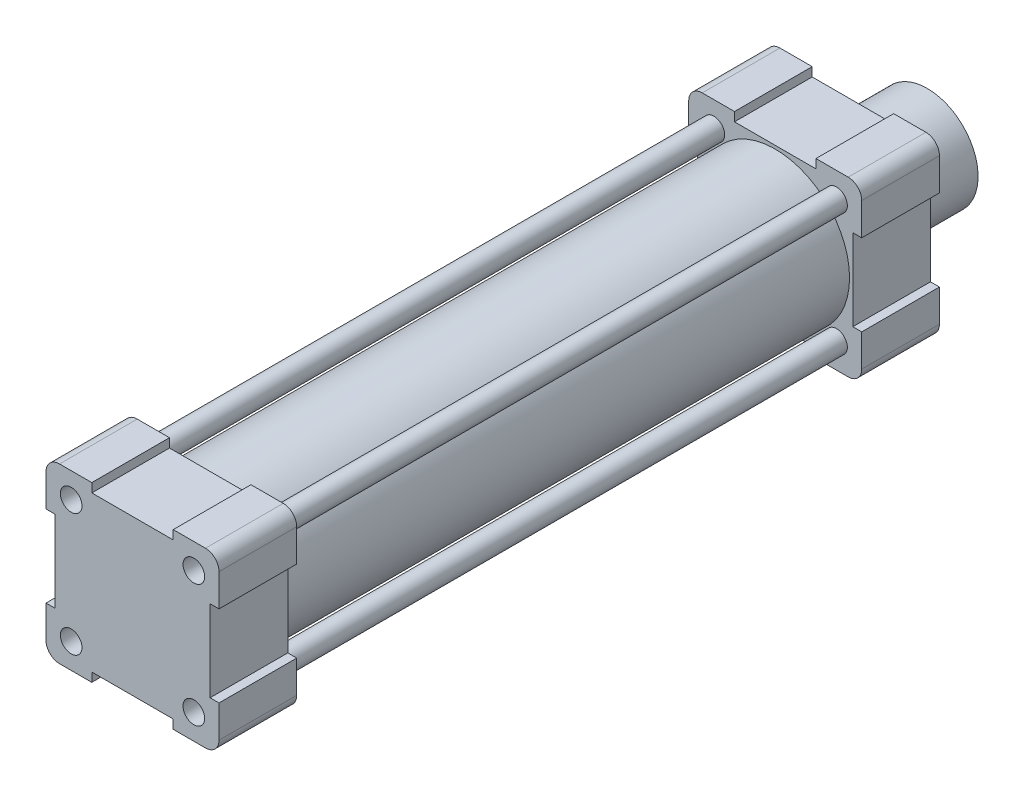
from build123d import *

# Parameters (mm, degrees)
SKETCH1_R             = 27.5
BOSS_EXTRUDE3_DEPTH   = 209
SKETCH3_R             = 4
BOSS_EXTRUDE4_DEPTH   = 28.75
SKETCH6_R             = 18.8
BOSS_EXTRUDE7_DEPTH   = 27.5
SKETCH7_R             = 10.025
CUT_EXTRUDE1_DEPTH    = 146
BOSS_EXTRUDE8_START   = -104.5
SKETCH8_R             = 4
BOSS_EXTRUDE8_DEPTH   = 209
BOSS_EXTRUDE8_2_DEPTH = 209
BOSS_EXTRUDE8_3_DEPTH = 209
BOSS_EXTRUDE8_4_DEPTH = 209


with BuildPart() as part:
    # Sketch1 → Boss-Extrude3 (new body)
    with BuildSketch(Plane.XY):
        Circle(SKETCH1_R)
    extrude(amount=BOSS_EXTRUDE3_DEPTH)

    # Sketch3 → Boss-Extrude4 (add)
    with BuildSketch(Plane.XY.offset(209)):
        with BuildLine():
            Line((-15.065, 32), (-27, 32))
            ThreePointArc((-27, 32), (-30.535533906, 30.535533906), (-32, 27))
            Line((-32, 27), (-32, 15.065))
            Line((-32, 15.065), (-28.69, 15.065))
            Line((-28.69, 15.065), (-28.69, -15.065))
            Line((-28.69, -15.065), (-32, -15.065))
            Line((-32, -15.065), (-32, -27))
            ThreePointArc((-32, -27), (-30.535533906, -30.535533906), (-27, -32))
            Line((-27, -32), (-15.065, -32))
            Line((-15.065, -32), (-15.065, -28.69))
            Line((-15.065, -28.69), (15.065, -28.69))
            Line((15.065, -28.69), (15.065, -32))
            Line((15.065, -32), (27, -32))
            ThreePointArc((27, -32), (30.535533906, -30.535533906), (32, -27))
            Line((32, -27), (32, -15.065))
            Line((32, -15.065), (28.69, -15.065))
            Line((28.69, -15.065), (28.69, 15.065))
            Line((28.69, 15.065), (32, 15.065))
            Line((32, 15.065), (32, 27))
            ThreePointArc((32, 27), (30.535533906, 30.535533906), (27, 32))
            Line((27, 32), (15.065, 32))
            Line((15.065, 32), (15.065, 28.69))
            Line((15.065, 28.69), (-15.065, 28.69))
            Line((-15.065, 28.69), (-15.065, 32))
        make_face()
        with Locations((-22.69, 22.69)):
            Circle(SKETCH3_R, mode=Mode.SUBTRACT)
        with Locations((22.69, 22.69)):
            Circle(SKETCH3_R, mode=Mode.SUBTRACT)
        with Locations((22.69, -22.69)):
            Circle(SKETCH3_R, mode=Mode.SUBTRACT)
        with Locations((-22.69, -22.69)):
            Circle(SKETCH3_R, mode=Mode.SUBTRACT)
    extrude(amount=BOSS_EXTRUDE4_DEPTH)

    # Mirror1: part across plane


with BuildPart() as part_1:
    add(part.part)
    add(part.part.mirror(Plane(origin=(0, 0, 104.5), x_dir=(1, 0, 0), z_dir=(0, 0, -1))))

    # Sketch6 → Boss-Extrude7 (add)
    with BuildSketch(Plane(origin=(0, 0, -28.75), x_dir=(-1, 0, 0), z_dir=(0, 0, -1))):
        Circle(SKETCH6_R)
    extrude(amount=BOSS_EXTRUDE7_DEPTH)

    # Sketch7 → Cut-Extrude1 (cut)
    with BuildSketch(Plane(origin=(0, 0, -56.25), x_dir=(-1, 0, 0), z_dir=(0, 0, -1))):
        Circle(SKETCH7_R)
    extrude(amount=-CUT_EXTRUDE1_DEPTH, mode=Mode.SUBTRACT)


with BuildPart() as body_2:
    # Sketch8 → Boss-Extrude8 (new body)
    with BuildSketch(Plane(origin=(0, 0, 104.5), x_dir=(-1, 0, 0), z_dir=(0, 0, -1)).offset(BOSS_EXTRUDE8_START)):
        with Locations(Location((-22.69, 22.69, 0), (0, 0, 180))):
            Circle(SKETCH8_R)
    extrude(amount=BOSS_EXTRUDE8_DEPTH)


with BuildPart() as body_3:
    # Sketch8 → Boss-Extrude8 2 (new body)
    with BuildSketch(Plane(origin=(0, 0, 104.5), x_dir=(-1, 0, 0), z_dir=(0, 0, -1)).offset(BOSS_EXTRUDE8_START)):
        with Locations(Location((22.69, 22.69, 0), (0, 0, 180))):
            Circle(SKETCH8_R)
    extrude(amount=BOSS_EXTRUDE8_2_DEPTH)


with BuildPart() as body_4:
    # Sketch8 → Boss-Extrude8 3 (new body)
    with BuildSketch(Plane(origin=(0, 0, 104.5), x_dir=(-1, 0, 0), z_dir=(0, 0, -1)).offset(BOSS_EXTRUDE8_START)):
        with Locations(Location((22.69, -22.69, 0), (0, 0, 180))):
            Circle(SKETCH8_R)
    extrude(amount=BOSS_EXTRUDE8_3_DEPTH)


with BuildPart() as body_5:
    # Sketch8 → Boss-Extrude8 4 (new body)
    with BuildSketch(Plane(origin=(0, 0, 104.5), x_dir=(-1, 0, 0), z_dir=(0, 0, -1)).offset(BOSS_EXTRUDE8_START)):
        with Locations(Location((-22.69, -22.69, 0), (0, 0, 180))):
            Circle(SKETCH8_R)
    extrude(amount=BOSS_EXTRUDE8_4_DEPTH)


solid = Compound([part_1.part, body_2.part, body_3.part, body_4.part, body_5.part])
